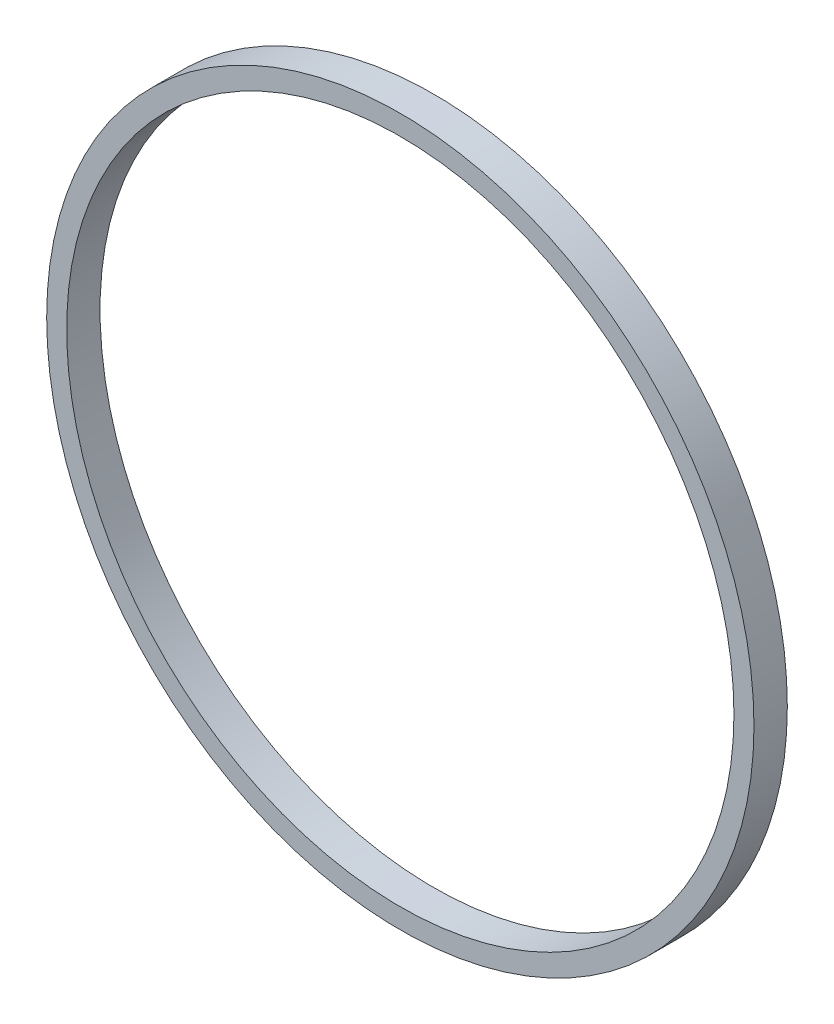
ISO-10303-21;
HEADER;
FILE_DESCRIPTION(('STEP AP214'),'2;1');
FILE_NAME('part.step','',(''),(''),'','','');
FILE_SCHEMA(('AUTOMOTIVE_DESIGN { 1 0 10303 214 1 1 1 1 }'));
ENDSEC;
DATA;
#1=APPLICATION_CONTEXT('core data for automotive mechanical design processes');
#2=APPLICATION_PROTOCOL_DEFINITION('international standard','automotive_design',2000,#1);
#3=PRODUCT_CONTEXT('',#1,'mechanical');
#4=PRODUCT('Part','Part','',(#3));
#5=PRODUCT_RELATED_PRODUCT_CATEGORY('part','',(#4));
#6=PRODUCT_DEFINITION_FORMATION('','',#4);
#7=PRODUCT_DEFINITION_CONTEXT('part definition',#1,'design');
#8=PRODUCT_DEFINITION('design','',#6,#7);
#9=PRODUCT_DEFINITION_SHAPE('','',#8);
#10=(LENGTH_UNIT() NAMED_UNIT(*) SI_UNIT(.MILLI.,.METRE.));
#11=(NAMED_UNIT(*) PLANE_ANGLE_UNIT() SI_UNIT($,.RADIAN.));
#12=(NAMED_UNIT(*) SI_UNIT($,.STERADIAN.) SOLID_ANGLE_UNIT());
#13=UNCERTAINTY_MEASURE_WITH_UNIT(LENGTH_MEASURE(1.E-05),#10,'distance_accuracy_value','');
#14=(GEOMETRIC_REPRESENTATION_CONTEXT(3) GLOBAL_UNCERTAINTY_ASSIGNED_CONTEXT((#13)) GLOBAL_UNIT_ASSIGNED_CONTEXT((#10,
#11,#12)) REPRESENTATION_CONTEXT('',''));
#15=CARTESIAN_POINT('',(0.,0.,0.));
#16=DIRECTION('',(0.,0.,1.));
#17=DIRECTION('',(1.,0.,0.));
#18=AXIS2_PLACEMENT_3D('',#15,#16,#17);
#19=CARTESIAN_POINT('',(0.,0.,2.5));
#20=DIRECTION('',(0.,0.,1.));
#21=DIRECTION('',(1.,0.,0.));
#22=AXIS2_PLACEMENT_3D('',#19,#20,#21);
#23=PLANE('',#22);
#24=CARTESIAN_POINT('',(0.,0.,2.5));
#25=DIRECTION('',(0.,0.,1.));
#26=DIRECTION('',(1.,0.,0.));
#27=AXIS2_PLACEMENT_3D('',#24,#25,#26);
#28=CIRCLE('',#27,26.5);
#29=CARTESIAN_POINT('',(26.5,0.,2.5));
#30=VERTEX_POINT('',#29);
#31=EDGE_CURVE('E10',#30,#30,#28,.T.);
#32=ORIENTED_EDGE('',*,*,#31,.T.);
#33=EDGE_LOOP('',(#32));
#34=FACE_BOUND('',#33,.T.);
#35=CARTESIAN_POINT('',(0.,0.,2.5));
#36=DIRECTION('',(0.,0.,1.));
#37=DIRECTION('',(1.,0.,0.));
#38=AXIS2_PLACEMENT_3D('',#35,#36,#37);
#39=CIRCLE('',#38,25.);
#40=CARTESIAN_POINT('',(25.,0.,2.5));
#41=VERTEX_POINT('',#40);
#42=EDGE_CURVE('E40',#41,#41,#39,.T.);
#43=ORIENTED_EDGE('',*,*,#42,.F.);
#44=EDGE_LOOP('',(#43));
#45=FACE_BOUND('',#44,.T.);
#46=ADVANCED_FACE('F29',(#34,#45),#23,.T.);
#47=CARTESIAN_POINT('',(0.,0.,0.));
#48=DIRECTION('',(0.,0.,1.));
#49=DIRECTION('',(1.,0.,0.));
#50=AXIS2_PLACEMENT_3D('',#47,#48,#49);
#51=PLANE('',#50);
#52=CARTESIAN_POINT('',(0.,0.,0.));
#53=DIRECTION('',(0.,0.,1.));
#54=DIRECTION('',(1.,0.,0.));
#55=AXIS2_PLACEMENT_3D('',#52,#53,#54);
#56=CIRCLE('',#55,26.5);
#57=CARTESIAN_POINT('',(26.5,0.,0.));
#58=VERTEX_POINT('',#57);
#59=EDGE_CURVE('E33',#58,#58,#56,.T.);
#60=ORIENTED_EDGE('',*,*,#59,.F.);
#61=EDGE_LOOP('',(#60));
#62=FACE_BOUND('',#61,.T.);
#63=CARTESIAN_POINT('',(0.,0.,0.));
#64=DIRECTION('',(0.,0.,1.));
#65=DIRECTION('',(1.,0.,0.));
#66=AXIS2_PLACEMENT_3D('',#63,#64,#65);
#67=CIRCLE('',#66,25.);
#68=CARTESIAN_POINT('',(25.,0.,0.));
#69=VERTEX_POINT('',#68);
#70=EDGE_CURVE('E42',#69,#69,#67,.T.);
#71=ORIENTED_EDGE('',*,*,#70,.T.);
#72=EDGE_LOOP('',(#71));
#73=FACE_BOUND('',#72,.T.);
#74=ADVANCED_FACE('F52',(#62,#73),#51,.F.);
#75=CARTESIAN_POINT('',(0.,0.,2.5));
#76=DIRECTION('',(0.,0.,-1.));
#77=DIRECTION('',(-1.,0.,0.));
#78=AXIS2_PLACEMENT_3D('',#75,#76,#77);
#79=CYLINDRICAL_SURFACE('',#78,26.5);
#80=ORIENTED_EDGE('',*,*,#31,.F.);
#81=EDGE_LOOP('',(#80));
#82=FACE_BOUND('',#81,.T.);
#83=ORIENTED_EDGE('',*,*,#59,.T.);
#84=EDGE_LOOP('',(#83));
#85=FACE_BOUND('',#84,.T.);
#86=ADVANCED_FACE('F31',(#82,#85),#79,.T.);
#87=CARTESIAN_POINT('',(0.,0.,2.5));
#88=DIRECTION('',(0.,0.,-1.));
#89=DIRECTION('',(-1.,0.,0.));
#90=AXIS2_PLACEMENT_3D('',#87,#88,#89);
#91=CYLINDRICAL_SURFACE('',#90,25.);
#92=ORIENTED_EDGE('',*,*,#42,.T.);
#93=EDGE_LOOP('',(#92));
#94=FACE_BOUND('',#93,.T.);
#95=ORIENTED_EDGE('',*,*,#70,.F.);
#96=EDGE_LOOP('',(#95));
#97=FACE_BOUND('',#96,.T.);
#98=ADVANCED_FACE('F48',(#94,#97),#91,.F.);
#99=CLOSED_SHELL('',(#46,#74,#86,#98));
#100=MANIFOLD_SOLID_BREP('B2',#99);
#101=ADVANCED_BREP_SHAPE_REPRESENTATION('',(#18,#100),#14);
#102=SHAPE_DEFINITION_REPRESENTATION(#9,#101);
ENDSEC;
END-ISO-10303-21;
